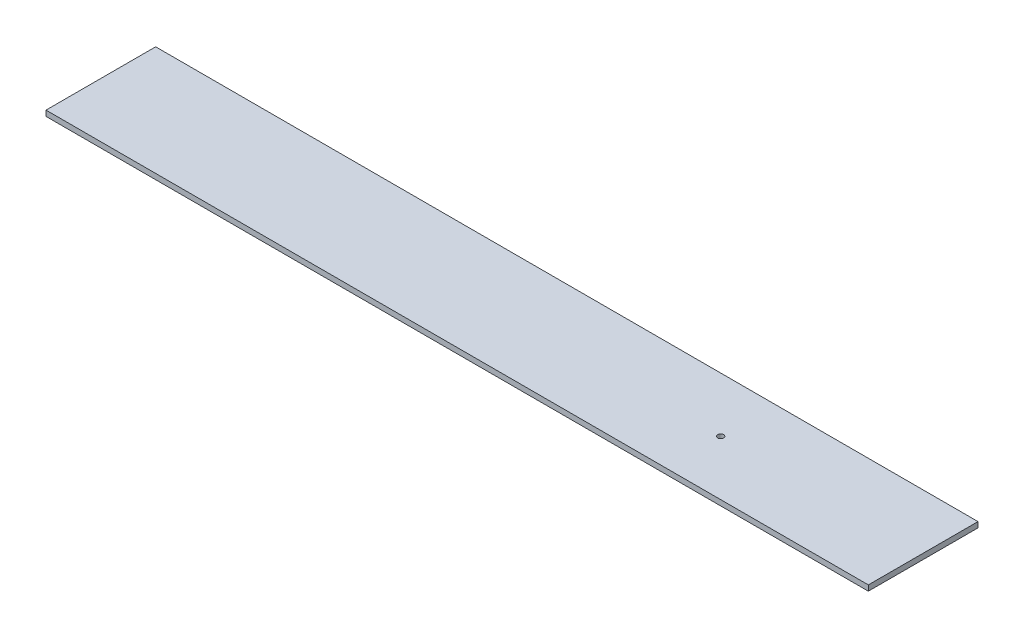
from build123d import *

# Parameters (mm, degrees)
SKETCH1_W       = 15000
SKETCH1_H       = 2000
MAIN_DEPTH      = 100
SKETCH2_R       = 53.975
GOLF_HOLE_DEPTH = 110
SKETCH3_R       = 4
TEE_HOLE_DEPTH  = 43.6


with BuildPart() as part:
    # Sketch1 → Main (new body)
    with BuildSketch(Plane(origin=(0, 0, 0), x_dir=(1, 0, 0), z_dir=(0, 1, 0))):
        with Locations((5000, 0)):
            Rectangle(SKETCH1_W, SKETCH1_H)
    extrude(amount=-MAIN_DEPTH)

    # Sketch2 → Golf Hole (cut)
    with BuildSketch(Plane(origin=(0, 0, 0), x_dir=(1, 0, 0), z_dir=(0, 1, 0))):
        with Locations(Location((8806.34, -0.000395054, 0), (0, 0, 270))):
            Circle(SKETCH2_R)
    extrude(amount=-GOLF_HOLE_DEPTH, mode=Mode.SUBTRACT)

    # Sketch3 → Tee Hole (cut)
    with BuildSketch(Plane(origin=(0, 0, 0), x_dir=(1, 0, 0), z_dir=(0, 1, 0))):
        with Locations(Location((-193.66, 0, 0), (0, 0, 270))):
            Circle(SKETCH3_R)
    extrude(amount=-TEE_HOLE_DEPTH, mode=Mode.SUBTRACT)


solid = part.part
